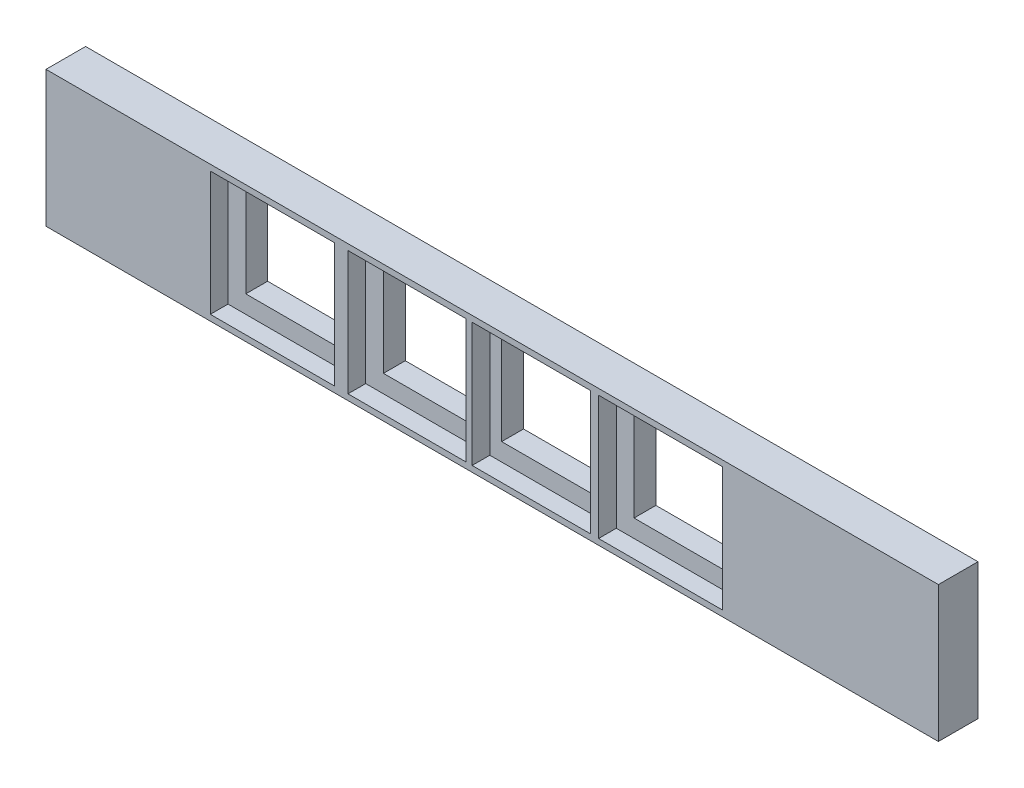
ISO-10303-21;
HEADER;
FILE_DESCRIPTION(('STEP AP214'),'2;1');
FILE_NAME('part.step','',(''),(''),'','','');
FILE_SCHEMA(('AUTOMOTIVE_DESIGN { 1 0 10303 214 1 1 1 1 }'));
ENDSEC;
DATA;
#1=APPLICATION_CONTEXT('core data for automotive mechanical design processes');
#2=APPLICATION_PROTOCOL_DEFINITION('international standard','automotive_design',2000,#1);
#3=PRODUCT_CONTEXT('',#1,'mechanical');
#4=PRODUCT('Part','Part','',(#3));
#5=PRODUCT_RELATED_PRODUCT_CATEGORY('part','',(#4));
#6=PRODUCT_DEFINITION_FORMATION('','',#4);
#7=PRODUCT_DEFINITION_CONTEXT('part definition',#1,'design');
#8=PRODUCT_DEFINITION('design','',#6,#7);
#9=PRODUCT_DEFINITION_SHAPE('','',#8);
#10=(LENGTH_UNIT() NAMED_UNIT(*) SI_UNIT(.MILLI.,.METRE.));
#11=(NAMED_UNIT(*) PLANE_ANGLE_UNIT() SI_UNIT($,.RADIAN.));
#12=(NAMED_UNIT(*) SI_UNIT($,.STERADIAN.) SOLID_ANGLE_UNIT());
#13=UNCERTAINTY_MEASURE_WITH_UNIT(LENGTH_MEASURE(1.E-05),#10,'distance_accuracy_value','');
#14=(GEOMETRIC_REPRESENTATION_CONTEXT(3) GLOBAL_UNCERTAINTY_ASSIGNED_CONTEXT((#13)) GLOBAL_UNIT_ASSIGNED_CONTEXT((#10,
#11,#12)) REPRESENTATION_CONTEXT('',''));
#15=CARTESIAN_POINT('',(0.,0.,0.));
#16=DIRECTION('',(0.,0.,1.));
#17=DIRECTION('',(1.,0.,0.));
#18=AXIS2_PLACEMENT_3D('',#15,#16,#17);
#19=CARTESIAN_POINT('',(96.5,19.,0.));
#20=DIRECTION('',(-1.,0.,0.));
#21=DIRECTION('',(0.,0.,1.));
#22=AXIS2_PLACEMENT_3D('',#19,#20,#21);
#23=PLANE('',#22);
#24=DIRECTION('',(0.,1.,0.));
#25=VECTOR('',#24,1.);
#26=CARTESIAN_POINT('',(96.5,19.,3.7));
#27=LINE('',#26,#25);
#28=CARTESIAN_POINT('',(96.5,4.,3.7));
#29=VERTEX_POINT('',#28);
#30=CARTESIAN_POINT('',(96.5,19.,3.7));
#31=VERTEX_POINT('',#30);
#32=EDGE_CURVE('E384',#29,#31,#27,.T.);
#33=ORIENTED_EDGE('',*,*,#32,.F.);
#34=DIRECTION('',(0.,0.,1.));
#35=VECTOR('',#34,1.);
#36=CARTESIAN_POINT('',(96.5,4.,0.));
#37=LINE('',#36,#35);
#38=CARTESIAN_POINT('',(96.5,4.,0.));
#39=VERTEX_POINT('',#38);
#40=EDGE_CURVE('E508',#39,#29,#37,.T.);
#41=ORIENTED_EDGE('',*,*,#40,.F.);
#42=DIRECTION('',(0.,-1.,0.));
#43=VECTOR('',#42,1.);
#44=CARTESIAN_POINT('',(96.5,19.,0.));
#45=LINE('',#44,#43);
#46=CARTESIAN_POINT('',(96.5,19.,0.));
#47=VERTEX_POINT('',#46);
#48=EDGE_CURVE('E442',#47,#39,#45,.T.);
#49=ORIENTED_EDGE('',*,*,#48,.F.);
#50=DIRECTION('',(0.,0.,1.));
#51=VECTOR('',#50,1.);
#52=CARTESIAN_POINT('',(96.5,19.,0.));
#53=LINE('',#52,#51);
#54=EDGE_CURVE('E509',#47,#31,#53,.T.);
#55=ORIENTED_EDGE('',*,*,#54,.T.);
#56=EDGE_LOOP('',(#33,#41,#49,#55));
#57=FACE_BOUND('',#56,.T.);
#58=ADVANCED_FACE('F35',(#57),#23,.F.);
#59=CARTESIAN_POINT('',(96.5,19.,0.));
#60=DIRECTION('',(0.,1.,0.));
#61=DIRECTION('',(0.,0.,1.));
#62=AXIS2_PLACEMENT_3D('',#59,#60,#61);
#63=PLANE('',#62);
#64=DIRECTION('',(1.,0.,0.));
#65=VECTOR('',#64,1.);
#66=CARTESIAN_POINT('',(96.5,19.,3.7));
#67=LINE('',#66,#65);
#68=CARTESIAN_POINT('',(111.5,19.,3.7));
#69=VERTEX_POINT('',#68);
#70=EDGE_CURVE('E382',#31,#69,#67,.T.);
#71=ORIENTED_EDGE('',*,*,#70,.F.);
#72=ORIENTED_EDGE('',*,*,#54,.F.);
#73=DIRECTION('',(-1.,0.,0.));
#74=VECTOR('',#73,1.);
#75=CARTESIAN_POINT('',(96.5,19.,0.));
#76=LINE('',#75,#74);
#77=CARTESIAN_POINT('',(111.5,19.,0.));
#78=VERTEX_POINT('',#77);
#79=EDGE_CURVE('E505',#78,#47,#76,.T.);
#80=ORIENTED_EDGE('',*,*,#79,.F.);
#81=DIRECTION('',(0.,0.,1.));
#82=VECTOR('',#81,1.);
#83=CARTESIAN_POINT('',(111.5,19.,0.));
#84=LINE('',#83,#82);
#85=EDGE_CURVE('E513',#78,#69,#84,.T.);
#86=ORIENTED_EDGE('',*,*,#85,.T.);
#87=EDGE_LOOP('',(#71,#72,#80,#86));
#88=FACE_BOUND('',#87,.T.);
#89=ADVANCED_FACE('F584',(#88),#63,.F.);
#90=CARTESIAN_POINT('',(111.5,19.,0.));
#91=DIRECTION('',(1.,0.,0.));
#92=DIRECTION('',(0.,0.,-1.));
#93=AXIS2_PLACEMENT_3D('',#90,#91,#92);
#94=PLANE('',#93);
#95=DIRECTION('',(0.,-1.,0.));
#96=VECTOR('',#95,1.);
#97=CARTESIAN_POINT('',(111.5,19.,3.7));
#98=LINE('',#97,#96);
#99=CARTESIAN_POINT('',(111.5,4.,3.7));
#100=VERTEX_POINT('',#99);
#101=EDGE_CURVE('E380',#69,#100,#98,.T.);
#102=ORIENTED_EDGE('',*,*,#101,.F.);
#103=ORIENTED_EDGE('',*,*,#85,.F.);
#104=DIRECTION('',(0.,1.,0.));
#105=VECTOR('',#104,1.);
#106=CARTESIAN_POINT('',(111.5,19.,0.));
#107=LINE('',#106,#105);
#108=CARTESIAN_POINT('',(111.5,4.,0.));
#109=VERTEX_POINT('',#108);
#110=EDGE_CURVE('E502',#109,#78,#107,.T.);
#111=ORIENTED_EDGE('',*,*,#110,.F.);
#112=DIRECTION('',(0.,0.,1.));
#113=VECTOR('',#112,1.);
#114=CARTESIAN_POINT('',(111.5,4.,0.));
#115=LINE('',#114,#113);
#116=EDGE_CURVE('E516',#109,#100,#115,.T.);
#117=ORIENTED_EDGE('',*,*,#116,.T.);
#118=EDGE_LOOP('',(#102,#103,#111,#117));
#119=FACE_BOUND('',#118,.T.);
#120=ADVANCED_FACE('F590',(#119),#94,.F.);
#121=CARTESIAN_POINT('',(96.5,4.,0.));
#122=DIRECTION('',(0.,-1.,0.));
#123=DIRECTION('',(0.,0.,-1.));
#124=AXIS2_PLACEMENT_3D('',#121,#122,#123);
#125=PLANE('',#124);
#126=DIRECTION('',(-1.,0.,0.));
#127=VECTOR('',#126,1.);
#128=CARTESIAN_POINT('',(96.5,4.,3.7));
#129=LINE('',#128,#127);
#130=EDGE_CURVE('E11',#100,#29,#129,.T.);
#131=ORIENTED_EDGE('',*,*,#130,.F.);
#132=ORIENTED_EDGE('',*,*,#116,.F.);
#133=DIRECTION('',(1.,0.,0.));
#134=VECTOR('',#133,1.);
#135=CARTESIAN_POINT('',(96.5,4.,0.));
#136=LINE('',#135,#134);
#137=EDGE_CURVE('E499',#39,#109,#136,.T.);
#138=ORIENTED_EDGE('',*,*,#137,.F.);
#139=ORIENTED_EDGE('',*,*,#40,.T.);
#140=EDGE_LOOP('',(#131,#132,#138,#139));
#141=FACE_BOUND('',#140,.T.);
#142=ADVANCED_FACE('F596',(#141),#125,.F.);
#143=CARTESIAN_POINT('',(69.1,19.,0.));
#144=DIRECTION('',(1.,0.,0.));
#145=DIRECTION('',(0.,0.,-1.));
#146=AXIS2_PLACEMENT_3D('',#143,#144,#145);
#147=PLANE('',#146);
#148=DIRECTION('',(0.,-1.,0.));
#149=VECTOR('',#148,1.);
#150=CARTESIAN_POINT('',(69.1,19.,3.7));
#151=LINE('',#150,#149);
#152=CARTESIAN_POINT('',(69.1,19.,3.7));
#153=VERTEX_POINT('',#152);
#154=CARTESIAN_POINT('',(69.1,4.,3.7));
#155=VERTEX_POINT('',#154);
#156=EDGE_CURVE('E378',#153,#155,#151,.T.);
#157=ORIENTED_EDGE('',*,*,#156,.F.);
#158=DIRECTION('',(0.,0.,1.));
#159=VECTOR('',#158,1.);
#160=CARTESIAN_POINT('',(69.1,19.,0.));
#161=LINE('',#160,#159);
#162=CARTESIAN_POINT('',(69.1,19.,0.));
#163=VERTEX_POINT('',#162);
#164=EDGE_CURVE('E464',#163,#153,#161,.T.);
#165=ORIENTED_EDGE('',*,*,#164,.F.);
#166=DIRECTION('',(0.,1.,0.));
#167=VECTOR('',#166,1.);
#168=CARTESIAN_POINT('',(69.1,19.,0.));
#169=LINE('',#168,#167);
#170=CARTESIAN_POINT('',(69.1,4.,0.));
#171=VERTEX_POINT('',#170);
#172=EDGE_CURVE('E451',#171,#163,#169,.T.);
#173=ORIENTED_EDGE('',*,*,#172,.F.);
#174=DIRECTION('',(0.,0.,1.));
#175=VECTOR('',#174,1.);
#176=CARTESIAN_POINT('',(69.1,4.,0.));
#177=LINE('',#176,#175);
#178=EDGE_CURVE('E429',#171,#155,#177,.T.);
#179=ORIENTED_EDGE('',*,*,#178,.T.);
#180=EDGE_LOOP('',(#157,#165,#173,#179));
#181=FACE_BOUND('',#180,.T.);
#182=ADVANCED_FACE('F562',(#181),#147,.F.);
#183=CARTESIAN_POINT('',(69.1,4.,0.));
#184=DIRECTION('',(0.,-1.,0.));
#185=DIRECTION('',(1.,0.,0.));
#186=AXIS2_PLACEMENT_3D('',#183,#184,#185);
#187=PLANE('',#186);
#188=DIRECTION('',(-1.,0.,0.));
#189=VECTOR('',#188,1.);
#190=CARTESIAN_POINT('',(69.1,4.,3.7));
#191=LINE('',#190,#189);
#192=CARTESIAN_POINT('',(54.1,4.,3.7));
#193=VERTEX_POINT('',#192);
#194=EDGE_CURVE('E376',#155,#193,#191,.T.);
#195=ORIENTED_EDGE('',*,*,#194,.F.);
#196=ORIENTED_EDGE('',*,*,#178,.F.);
#197=DIRECTION('',(1.,0.,0.));
#198=VECTOR('',#197,1.);
#199=CARTESIAN_POINT('',(69.1,4.,0.));
#200=LINE('',#199,#198);
#201=CARTESIAN_POINT('',(54.1,4.,0.));
#202=VERTEX_POINT('',#201);
#203=EDGE_CURVE('E461',#202,#171,#200,.T.);
#204=ORIENTED_EDGE('',*,*,#203,.F.);
#205=DIRECTION('',(0.,0.,1.));
#206=VECTOR('',#205,1.);
#207=CARTESIAN_POINT('',(54.1,4.,0.));
#208=LINE('',#207,#206);
#209=EDGE_CURVE('E467',#202,#193,#208,.T.);
#210=ORIENTED_EDGE('',*,*,#209,.T.);
#211=EDGE_LOOP('',(#195,#196,#204,#210));
#212=FACE_BOUND('',#211,.T.);
#213=ADVANCED_FACE('F571',(#212),#187,.F.);
#214=CARTESIAN_POINT('',(54.1,19.,0.));
#215=DIRECTION('',(-1.,0.,0.));
#216=DIRECTION('',(0.,0.,1.));
#217=AXIS2_PLACEMENT_3D('',#214,#215,#216);
#218=PLANE('',#217);
#219=DIRECTION('',(0.,1.,0.));
#220=VECTOR('',#219,1.);
#221=CARTESIAN_POINT('',(54.1,19.,3.7));
#222=LINE('',#221,#220);
#223=CARTESIAN_POINT('',(54.1,19.,3.7));
#224=VERTEX_POINT('',#223);
#225=EDGE_CURVE('E374',#193,#224,#222,.T.);
#226=ORIENTED_EDGE('',*,*,#225,.F.);
#227=ORIENTED_EDGE('',*,*,#209,.F.);
#228=DIRECTION('',(0.,-1.,0.));
#229=VECTOR('',#228,1.);
#230=CARTESIAN_POINT('',(54.1,19.,0.));
#231=LINE('',#230,#229);
#232=CARTESIAN_POINT('',(54.1,19.,0.));
#233=VERTEX_POINT('',#232);
#234=EDGE_CURVE('E458',#233,#202,#231,.T.);
#235=ORIENTED_EDGE('',*,*,#234,.F.);
#236=DIRECTION('',(0.,0.,1.));
#237=VECTOR('',#236,1.);
#238=CARTESIAN_POINT('',(54.1,19.,0.));
#239=LINE('',#238,#237);
#240=EDGE_CURVE('E470',#233,#224,#239,.T.);
#241=ORIENTED_EDGE('',*,*,#240,.T.);
#242=EDGE_LOOP('',(#226,#227,#235,#241));
#243=FACE_BOUND('',#242,.T.);
#244=ADVANCED_FACE('F573',(#243),#218,.F.);
#245=CARTESIAN_POINT('',(69.1,19.,0.));
#246=DIRECTION('',(0.,1.,0.));
#247=DIRECTION('',(0.,0.,1.));
#248=AXIS2_PLACEMENT_3D('',#245,#246,#247);
#249=PLANE('',#248);
#250=DIRECTION('',(1.,0.,0.));
#251=VECTOR('',#250,1.);
#252=CARTESIAN_POINT('',(69.1,19.,3.7));
#253=LINE('',#252,#251);
#254=EDGE_CURVE('E43',#224,#153,#253,.T.);
#255=ORIENTED_EDGE('',*,*,#254,.F.);
#256=ORIENTED_EDGE('',*,*,#240,.F.);
#257=DIRECTION('',(-1.,0.,0.));
#258=VECTOR('',#257,1.);
#259=CARTESIAN_POINT('',(69.1,19.,0.));
#260=LINE('',#259,#258);
#261=EDGE_CURVE('E454',#163,#233,#260,.T.);
#262=ORIENTED_EDGE('',*,*,#261,.F.);
#263=ORIENTED_EDGE('',*,*,#164,.T.);
#264=EDGE_LOOP('',(#255,#256,#262,#263));
#265=FACE_BOUND('',#264,.T.);
#266=ADVANCED_FACE('F565',(#265),#249,.F.);
#267=CARTESIAN_POINT('',(74.1,19.,0.));
#268=DIRECTION('',(-1.,0.,0.));
#269=DIRECTION('',(0.,0.,1.));
#270=AXIS2_PLACEMENT_3D('',#267,#268,#269);
#271=PLANE('',#270);
#272=DIRECTION('',(0.,1.,0.));
#273=VECTOR('',#272,1.);
#274=CARTESIAN_POINT('',(74.1,19.,3.7));
#275=LINE('',#274,#273);
#276=CARTESIAN_POINT('',(74.1,4.,3.7));
#277=VERTEX_POINT('',#276);
#278=CARTESIAN_POINT('',(74.1,19.,3.7));
#279=VERTEX_POINT('',#278);
#280=EDGE_CURVE('E372',#277,#279,#275,.T.);
#281=ORIENTED_EDGE('',*,*,#280,.F.);
#282=DIRECTION('',(0.,0.,1.));
#283=VECTOR('',#282,1.);
#284=CARTESIAN_POINT('',(74.1,4.,0.));
#285=LINE('',#284,#283);
#286=CARTESIAN_POINT('',(74.1,4.,0.));
#287=VERTEX_POINT('',#286);
#288=EDGE_CURVE('E438',#287,#277,#285,.T.);
#289=ORIENTED_EDGE('',*,*,#288,.F.);
#290=DIRECTION('',(0.,-1.,0.));
#291=VECTOR('',#290,1.);
#292=CARTESIAN_POINT('',(74.1,19.,0.));
#293=LINE('',#292,#291);
#294=CARTESIAN_POINT('',(74.1,19.,0.));
#295=VERTEX_POINT('',#294);
#296=EDGE_CURVE('E425',#295,#287,#293,.T.);
#297=ORIENTED_EDGE('',*,*,#296,.F.);
#298=DIRECTION('',(0.,0.,1.));
#299=VECTOR('',#298,1.);
#300=CARTESIAN_POINT('',(74.1,19.,0.));
#301=LINE('',#300,#299);
#302=EDGE_CURVE('E439',#295,#279,#301,.T.);
#303=ORIENTED_EDGE('',*,*,#302,.T.);
#304=EDGE_LOOP('',(#281,#289,#297,#303));
#305=FACE_BOUND('',#304,.T.);
#306=ADVANCED_FACE('F580',(#305),#271,.F.);
#307=CARTESIAN_POINT('',(74.1,19.,0.));
#308=DIRECTION('',(0.,1.,0.));
#309=DIRECTION('',(0.,0.,1.));
#310=AXIS2_PLACEMENT_3D('',#307,#308,#309);
#311=PLANE('',#310);
#312=DIRECTION('',(1.,0.,0.));
#313=VECTOR('',#312,1.);
#314=CARTESIAN_POINT('',(74.1,19.,3.7));
#315=LINE('',#314,#313);
#316=CARTESIAN_POINT('',(89.1,19.,3.7));
#317=VERTEX_POINT('',#316);
#318=EDGE_CURVE('E370',#279,#317,#315,.T.);
#319=ORIENTED_EDGE('',*,*,#318,.F.);
#320=ORIENTED_EDGE('',*,*,#302,.F.);
#321=DIRECTION('',(-1.,0.,0.));
#322=VECTOR('',#321,1.);
#323=CARTESIAN_POINT('',(74.1,19.,0.));
#324=LINE('',#323,#322);
#325=CARTESIAN_POINT('',(89.1,19.,0.));
#326=VERTEX_POINT('',#325);
#327=EDGE_CURVE('E435',#326,#295,#324,.T.);
#328=ORIENTED_EDGE('',*,*,#327,.F.);
#329=DIRECTION('',(0.,0.,1.));
#330=VECTOR('',#329,1.);
#331=CARTESIAN_POINT('',(89.1,19.,0.));
#332=LINE('',#331,#330);
#333=EDGE_CURVE('E443',#326,#317,#332,.T.);
#334=ORIENTED_EDGE('',*,*,#333,.T.);
#335=EDGE_LOOP('',(#319,#320,#328,#334));
#336=FACE_BOUND('',#335,.T.);
#337=ADVANCED_FACE('F714',(#336),#311,.F.);
#338=CARTESIAN_POINT('',(89.1,19.,0.));
#339=DIRECTION('',(1.,0.,0.));
#340=DIRECTION('',(0.,0.,-1.));
#341=AXIS2_PLACEMENT_3D('',#338,#339,#340);
#342=PLANE('',#341);
#343=DIRECTION('',(0.,-1.,0.));
#344=VECTOR('',#343,1.);
#345=CARTESIAN_POINT('',(89.1,19.,3.7));
#346=LINE('',#345,#344);
#347=CARTESIAN_POINT('',(89.1,4.,3.7));
#348=VERTEX_POINT('',#347);
#349=EDGE_CURVE('E304',#317,#348,#346,.T.);
#350=ORIENTED_EDGE('',*,*,#349,.F.);
#351=ORIENTED_EDGE('',*,*,#333,.F.);
#352=DIRECTION('',(0.,1.,0.));
#353=VECTOR('',#352,1.);
#354=CARTESIAN_POINT('',(89.1,19.,0.));
#355=LINE('',#354,#353);
#356=CARTESIAN_POINT('',(89.1,4.,0.));
#357=VERTEX_POINT('',#356);
#358=EDGE_CURVE('E432',#357,#326,#355,.T.);
#359=ORIENTED_EDGE('',*,*,#358,.F.);
#360=DIRECTION('',(0.,0.,1.));
#361=VECTOR('',#360,1.);
#362=CARTESIAN_POINT('',(89.1,4.,0.));
#363=LINE('',#362,#361);
#364=EDGE_CURVE('E446',#357,#348,#363,.T.);
#365=ORIENTED_EDGE('',*,*,#364,.T.);
#366=EDGE_LOOP('',(#350,#351,#359,#365));
#367=FACE_BOUND('',#366,.T.);
#368=ADVANCED_FACE('F717',(#367),#342,.F.);
#369=CARTESIAN_POINT('',(74.1,4.,0.));
#370=DIRECTION('',(0.,-1.,0.));
#371=DIRECTION('',(1.,0.,0.));
#372=AXIS2_PLACEMENT_3D('',#369,#370,#371);
#373=PLANE('',#372);
#374=DIRECTION('',(-1.,0.,0.));
#375=VECTOR('',#374,1.);
#376=CARTESIAN_POINT('',(74.1,4.,3.7));
#377=LINE('',#376,#375);
#378=EDGE_CURVE('E554',#348,#277,#377,.T.);
#379=ORIENTED_EDGE('',*,*,#378,.F.);
#380=ORIENTED_EDGE('',*,*,#364,.F.);
#381=DIRECTION('',(1.,0.,0.));
#382=VECTOR('',#381,1.);
#383=CARTESIAN_POINT('',(74.1,4.,0.));
#384=LINE('',#383,#382);
#385=EDGE_CURVE('E428',#287,#357,#384,.T.);
#386=ORIENTED_EDGE('',*,*,#385,.F.);
#387=ORIENTED_EDGE('',*,*,#288,.T.);
#388=EDGE_LOOP('',(#379,#380,#386,#387));
#389=FACE_BOUND('',#388,.T.);
#390=ADVANCED_FACE('F648',(#389),#373,.F.);
#391=CARTESIAN_POINT('',(45.8,19.,0.));
#392=DIRECTION('',(1.,0.,0.));
#393=DIRECTION('',(0.,0.,-1.));
#394=AXIS2_PLACEMENT_3D('',#391,#392,#393);
#395=PLANE('',#394);
#396=DIRECTION('',(0.,-1.,0.));
#397=VECTOR('',#396,1.);
#398=CARTESIAN_POINT('',(45.8,19.,3.7));
#399=LINE('',#398,#397);
#400=CARTESIAN_POINT('',(45.8,19.,3.7));
#401=VERTEX_POINT('',#400);
#402=CARTESIAN_POINT('',(45.8,4.,3.7));
#403=VERTEX_POINT('',#402);
#404=EDGE_CURVE('E422',#401,#403,#399,.T.);
#405=ORIENTED_EDGE('',*,*,#404,.F.);
#406=DIRECTION('',(0.,0.,1.));
#407=VECTOR('',#406,1.);
#408=CARTESIAN_POINT('',(45.8,19.,0.));
#409=LINE('',#408,#407);
#410=CARTESIAN_POINT('',(45.8,19.,0.));
#411=VERTEX_POINT('',#410);
#412=EDGE_CURVE('E486',#411,#401,#409,.T.);
#413=ORIENTED_EDGE('',*,*,#412,.F.);
#414=DIRECTION('',(0.,1.,0.));
#415=VECTOR('',#414,1.);
#416=CARTESIAN_POINT('',(45.8,19.,0.));
#417=LINE('',#416,#415);
#418=CARTESIAN_POINT('',(45.8,4.,0.));
#419=VERTEX_POINT('',#418);
#420=EDGE_CURVE('E424',#419,#411,#417,.T.);
#421=ORIENTED_EDGE('',*,*,#420,.F.);
#422=DIRECTION('',(0.,0.,1.));
#423=VECTOR('',#422,1.);
#424=CARTESIAN_POINT('',(45.8,4.,0.));
#425=LINE('',#424,#423);
#426=EDGE_CURVE('E455',#419,#403,#425,.T.);
#427=ORIENTED_EDGE('',*,*,#426,.T.);
#428=EDGE_LOOP('',(#405,#413,#421,#427));
#429=FACE_BOUND('',#428,.T.);
#430=ADVANCED_FACE('F646',(#429),#395,.F.);
#431=CARTESIAN_POINT('',(45.8,4.,0.));
#432=DIRECTION('',(0.,-1.,0.));
#433=DIRECTION('',(1.,0.,0.));
#434=AXIS2_PLACEMENT_3D('',#431,#432,#433);
#435=PLANE('',#434);
#436=DIRECTION('',(-1.,0.,0.));
#437=VECTOR('',#436,1.);
#438=CARTESIAN_POINT('',(45.8,4.,3.7));
#439=LINE('',#438,#437);
#440=CARTESIAN_POINT('',(30.8,4.,3.7));
#441=VERTEX_POINT('',#440);
#442=EDGE_CURVE('E420',#403,#441,#439,.T.);
#443=ORIENTED_EDGE('',*,*,#442,.F.);
#444=ORIENTED_EDGE('',*,*,#426,.F.);
#445=DIRECTION('',(1.,0.,0.));
#446=VECTOR('',#445,1.);
#447=CARTESIAN_POINT('',(45.8,4.,0.));
#448=LINE('',#447,#446);
#449=CARTESIAN_POINT('',(30.8,4.,0.));
#450=VERTEX_POINT('',#449);
#451=EDGE_CURVE('E483',#450,#419,#448,.T.);
#452=ORIENTED_EDGE('',*,*,#451,.F.);
#453=DIRECTION('',(0.,0.,1.));
#454=VECTOR('',#453,1.);
#455=CARTESIAN_POINT('',(30.8,4.,0.));
#456=LINE('',#455,#454);
#457=EDGE_CURVE('E489',#450,#441,#456,.T.);
#458=ORIENTED_EDGE('',*,*,#457,.T.);
#459=EDGE_LOOP('',(#443,#444,#452,#458));
#460=FACE_BOUND('',#459,.T.);
#461=ADVANCED_FACE('F640',(#460),#435,.F.);
#462=CARTESIAN_POINT('',(30.8,19.,0.));
#463=DIRECTION('',(-1.,0.,0.));
#464=DIRECTION('',(0.,-1.,0.));
#465=AXIS2_PLACEMENT_3D('',#462,#463,#464);
#466=PLANE('',#465);
#467=DIRECTION('',(0.,1.,0.));
#468=VECTOR('',#467,1.);
#469=CARTESIAN_POINT('',(30.8,19.,3.7));
#470=LINE('',#469,#468);
#471=CARTESIAN_POINT('',(30.8,19.,3.7));
#472=VERTEX_POINT('',#471);
#473=EDGE_CURVE('E412',#441,#472,#470,.T.);
#474=ORIENTED_EDGE('',*,*,#473,.F.);
#475=ORIENTED_EDGE('',*,*,#457,.F.);
#476=DIRECTION('',(0.,-1.,0.));
#477=VECTOR('',#476,1.);
#478=CARTESIAN_POINT('',(30.8,19.,0.));
#479=LINE('',#478,#477);
#480=CARTESIAN_POINT('',(30.8,19.,0.));
#481=VERTEX_POINT('',#480);
#482=EDGE_CURVE('E480',#481,#450,#479,.T.);
#483=ORIENTED_EDGE('',*,*,#482,.F.);
#484=DIRECTION('',(0.,0.,1.));
#485=VECTOR('',#484,1.);
#486=CARTESIAN_POINT('',(30.8,19.,0.));
#487=LINE('',#486,#485);
#488=EDGE_CURVE('E492',#481,#472,#487,.T.);
#489=ORIENTED_EDGE('',*,*,#488,.T.);
#490=EDGE_LOOP('',(#474,#475,#483,#489));
#491=FACE_BOUND('',#490,.T.);
#492=ADVANCED_FACE('F634',(#491),#466,.F.);
#493=CARTESIAN_POINT('',(45.8,19.,0.));
#494=DIRECTION('',(0.,1.,0.));
#495=DIRECTION('',(-1.,0.,0.));
#496=AXIS2_PLACEMENT_3D('',#493,#494,#495);
#497=PLANE('',#496);
#498=DIRECTION('',(1.,0.,0.));
#499=VECTOR('',#498,1.);
#500=CARTESIAN_POINT('',(45.8,19.,3.7));
#501=LINE('',#500,#499);
#502=EDGE_CURVE('E552',#472,#401,#501,.T.);
#503=ORIENTED_EDGE('',*,*,#502,.F.);
#504=ORIENTED_EDGE('',*,*,#488,.F.);
#505=DIRECTION('',(-1.,0.,0.));
#506=VECTOR('',#505,1.);
#507=CARTESIAN_POINT('',(45.8,19.,0.));
#508=LINE('',#507,#506);
#509=EDGE_CURVE('E477',#411,#481,#508,.T.);
#510=ORIENTED_EDGE('',*,*,#509,.F.);
#511=ORIENTED_EDGE('',*,*,#412,.T.);
#512=EDGE_LOOP('',(#503,#504,#510,#511));
#513=FACE_BOUND('',#512,.T.);
#514=ADVANCED_FACE('F619',(#513),#497,.F.);
#515=CARTESIAN_POINT('',(0.,0.,6.7));
#516=DIRECTION('',(0.,1.,0.));
#517=DIRECTION('',(0.,0.,1.));
#518=AXIS2_PLACEMENT_3D('',#515,#516,#517);
#519=PLANE('',#518);
#520=DIRECTION('',(1.,0.,0.));
#521=VECTOR('',#520,1.);
#522=CARTESIAN_POINT('',(0.,0.,0.));
#523=LINE('',#522,#521);
#524=CARTESIAN_POINT('',(0.,0.,0.));
#525=VERTEX_POINT('',#524);
#526=CARTESIAN_POINT('',(151.,0.,0.));
#527=VERTEX_POINT('',#526);
#528=EDGE_CURVE('E512',#525,#527,#523,.T.);
#529=ORIENTED_EDGE('',*,*,#528,.T.);
#530=DIRECTION('',(0.,0.,-1.));
#531=VECTOR('',#530,1.);
#532=CARTESIAN_POINT('',(151.,0.,6.7));
#533=LINE('',#532,#531);
#534=CARTESIAN_POINT('',(151.,0.,6.7));
#535=VERTEX_POINT('',#534);
#536=EDGE_CURVE('E549',#535,#527,#533,.T.);
#537=ORIENTED_EDGE('',*,*,#536,.F.);
#538=DIRECTION('',(1.,0.,0.));
#539=VECTOR('',#538,1.);
#540=CARTESIAN_POINT('',(0.,0.,6.7));
#541=LINE('',#540,#539);
#542=CARTESIAN_POINT('',(0.,0.,6.7));
#543=VERTEX_POINT('',#542);
#544=EDGE_CURVE('E521',#543,#535,#541,.T.);
#545=ORIENTED_EDGE('',*,*,#544,.F.);
#546=DIRECTION('',(0.,0.,-1.));
#547=VECTOR('',#546,1.);
#548=CARTESIAN_POINT('',(0.,0.,6.7));
#549=LINE('',#548,#547);
#550=EDGE_CURVE('E533',#543,#525,#549,.T.);
#551=ORIENTED_EDGE('',*,*,#550,.T.);
#552=EDGE_LOOP('',(#529,#537,#545,#551));
#553=FACE_BOUND('',#552,.T.);
#554=ADVANCED_FACE('F37',(#553),#519,.F.);
#555=CARTESIAN_POINT('',(151.,0.,6.7));
#556=DIRECTION('',(-1.,0.,0.));
#557=DIRECTION('',(0.,0.,1.));
#558=AXIS2_PLACEMENT_3D('',#555,#556,#557);
#559=PLANE('',#558);
#560=DIRECTION('',(0.,1.,0.));
#561=VECTOR('',#560,1.);
#562=CARTESIAN_POINT('',(151.,0.,0.));
#563=LINE('',#562,#561);
#564=CARTESIAN_POINT('',(151.,23.,0.));
#565=VERTEX_POINT('',#564);
#566=EDGE_CURVE('E536',#527,#565,#563,.T.);
#567=ORIENTED_EDGE('',*,*,#566,.T.);
#568=DIRECTION('',(0.,0.,-1.));
#569=VECTOR('',#568,1.);
#570=CARTESIAN_POINT('',(151.,23.,6.7));
#571=LINE('',#570,#569);
#572=CARTESIAN_POINT('',(151.,23.,6.7));
#573=VERTEX_POINT('',#572);
#574=EDGE_CURVE('E547',#573,#565,#571,.T.);
#575=ORIENTED_EDGE('',*,*,#574,.F.);
#576=DIRECTION('',(0.,1.,0.));
#577=VECTOR('',#576,1.);
#578=CARTESIAN_POINT('',(151.,0.,6.7));
#579=LINE('',#578,#577);
#580=EDGE_CURVE('E524',#535,#573,#579,.T.);
#581=ORIENTED_EDGE('',*,*,#580,.F.);
#582=ORIENTED_EDGE('',*,*,#536,.T.);
#583=EDGE_LOOP('',(#567,#575,#581,#582));
#584=FACE_BOUND('',#583,.T.);
#585=ADVANCED_FACE('F612',(#584),#559,.F.);
#586=CARTESIAN_POINT('',(0.,23.,6.7));
#587=DIRECTION('',(0.,1.,0.));
#588=DIRECTION('',(0.,0.,1.));
#589=AXIS2_PLACEMENT_3D('',#586,#587,#588);
#590=PLANE('',#589);
#591=DIRECTION('',(1.,0.,0.));
#592=VECTOR('',#591,1.);
#593=CARTESIAN_POINT('',(0.,23.,0.));
#594=LINE('',#593,#592);
#595=CARTESIAN_POINT('',(0.,23.,0.));
#596=VERTEX_POINT('',#595);
#597=EDGE_CURVE('E539',#596,#565,#594,.T.);
#598=ORIENTED_EDGE('',*,*,#597,.F.);
#599=DIRECTION('',(0.,0.,-1.));
#600=VECTOR('',#599,1.);
#601=CARTESIAN_POINT('',(0.,23.,6.7));
#602=LINE('',#601,#600);
#603=CARTESIAN_POINT('',(0.,23.,6.7));
#604=VERTEX_POINT('',#603);
#605=EDGE_CURVE('E545',#604,#596,#602,.T.);
#606=ORIENTED_EDGE('',*,*,#605,.F.);
#607=DIRECTION('',(1.,0.,0.));
#608=VECTOR('',#607,1.);
#609=CARTESIAN_POINT('',(0.,23.,6.7));
#610=LINE('',#609,#608);
#611=EDGE_CURVE('E527',#604,#573,#610,.T.);
#612=ORIENTED_EDGE('',*,*,#611,.T.);
#613=ORIENTED_EDGE('',*,*,#574,.T.);
#614=EDGE_LOOP('',(#598,#606,#612,#613));
#615=FACE_BOUND('',#614,.T.);
#616=ADVANCED_FACE('F609',(#615),#590,.T.);
#617=CARTESIAN_POINT('',(0.,0.,6.7));
#618=DIRECTION('',(-1.,0.,0.));
#619=DIRECTION('',(0.,0.,1.));
#620=AXIS2_PLACEMENT_3D('',#617,#618,#619);
#621=PLANE('',#620);
#622=DIRECTION('',(0.,1.,0.));
#623=VECTOR('',#622,1.);
#624=CARTESIAN_POINT('',(0.,0.,0.));
#625=LINE('',#624,#623);
#626=EDGE_CURVE('E525',#525,#596,#625,.T.);
#627=ORIENTED_EDGE('',*,*,#626,.F.);
#628=ORIENTED_EDGE('',*,*,#550,.F.);
#629=DIRECTION('',(0.,1.,0.));
#630=VECTOR('',#629,1.);
#631=CARTESIAN_POINT('',(0.,0.,6.7));
#632=LINE('',#631,#630);
#633=EDGE_CURVE('E530',#543,#604,#632,.T.);
#634=ORIENTED_EDGE('',*,*,#633,.T.);
#635=ORIENTED_EDGE('',*,*,#605,.T.);
#636=EDGE_LOOP('',(#627,#628,#634,#635));
#637=FACE_BOUND('',#636,.T.);
#638=ADVANCED_FACE('F601',(#637),#621,.T.);
#639=CARTESIAN_POINT('',(0.,0.,6.7));
#640=DIRECTION('',(0.,0.,1.));
#641=DIRECTION('',(1.,0.,0.));
#642=AXIS2_PLACEMENT_3D('',#639,#640,#641);
#643=PLANE('',#642);
#644=DIRECTION('',(0.,-1.,0.));
#645=VECTOR('',#644,1.);
#646=CARTESIAN_POINT('',(51.1,22.,6.7));
#647=LINE('',#646,#645);
#648=CARTESIAN_POINT('',(51.1,22.,6.7));
#649=VERTEX_POINT('',#648);
#650=CARTESIAN_POINT('',(51.1,0.999999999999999,6.7));
#651=VERTEX_POINT('',#650);
#652=EDGE_CURVE('E50',#649,#651,#647,.T.);
#653=ORIENTED_EDGE('',*,*,#652,.F.);
#654=DIRECTION('',(-1.,0.,0.));
#655=VECTOR('',#654,1.);
#656=CARTESIAN_POINT('',(51.1,22.,6.7));
#657=LINE('',#656,#655);
#658=CARTESIAN_POINT('',(71.1,22.,6.7));
#659=VERTEX_POINT('',#658);
#660=EDGE_CURVE('E288',#659,#649,#657,.T.);
#661=ORIENTED_EDGE('',*,*,#660,.F.);
#662=DIRECTION('',(0.,1.,0.));
#663=VECTOR('',#662,1.);
#664=CARTESIAN_POINT('',(71.1,22.,6.7));
#665=LINE('',#664,#663);
#666=CARTESIAN_POINT('',(71.1,0.999999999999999,6.7));
#667=VERTEX_POINT('',#666);
#668=EDGE_CURVE('E291',#667,#659,#665,.T.);
#669=ORIENTED_EDGE('',*,*,#668,.F.);
#670=DIRECTION('',(1.,0.,0.));
#671=VECTOR('',#670,1.);
#672=CARTESIAN_POINT('',(51.1,0.999999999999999,6.7));
#673=LINE('',#672,#671);
#674=EDGE_CURVE('E297',#651,#667,#673,.T.);
#675=ORIENTED_EDGE('',*,*,#674,.F.);
#676=EDGE_LOOP('',(#653,#661,#669,#675));
#677=FACE_BOUND('',#676,.T.);
#678=DIRECTION('',(0.,-1.,0.));
#679=VECTOR('',#678,1.);
#680=CARTESIAN_POINT('',(72.1,22.,6.7));
#681=LINE('',#680,#679);
#682=CARTESIAN_POINT('',(72.1,22.,6.7));
#683=VERTEX_POINT('',#682);
#684=CARTESIAN_POINT('',(72.1,1.,6.7));
#685=VERTEX_POINT('',#684);
#686=EDGE_CURVE('E58',#683,#685,#681,.T.);
#687=ORIENTED_EDGE('',*,*,#686,.F.);
#688=DIRECTION('',(-1.,0.,0.));
#689=VECTOR('',#688,1.);
#690=CARTESIAN_POINT('',(72.1,22.,6.7));
#691=LINE('',#690,#689);
#692=CARTESIAN_POINT('',(92.1,22.,6.7));
#693=VERTEX_POINT('',#692);
#694=EDGE_CURVE('E312',#693,#683,#691,.T.);
#695=ORIENTED_EDGE('',*,*,#694,.F.);
#696=DIRECTION('',(0.,1.,0.));
#697=VECTOR('',#696,1.);
#698=CARTESIAN_POINT('',(92.1,22.,6.7));
#699=LINE('',#698,#697);
#700=CARTESIAN_POINT('',(92.1,1.,6.7));
#701=VERTEX_POINT('',#700);
#702=EDGE_CURVE('E327',#701,#693,#699,.T.);
#703=ORIENTED_EDGE('',*,*,#702,.F.);
#704=DIRECTION('',(1.,0.,0.));
#705=VECTOR('',#704,1.);
#706=CARTESIAN_POINT('',(72.1,1.,6.7));
#707=LINE('',#706,#705);
#708=EDGE_CURVE('E323',#685,#701,#707,.T.);
#709=ORIENTED_EDGE('',*,*,#708,.F.);
#710=EDGE_LOOP('',(#687,#695,#703,#709));
#711=FACE_BOUND('',#710,.T.);
#712=DIRECTION('',(0.,-1.,0.));
#713=VECTOR('',#712,1.);
#714=CARTESIAN_POINT('',(93.5,22.,6.7));
#715=LINE('',#714,#713);
#716=CARTESIAN_POINT('',(93.5,22.,6.7));
#717=VERTEX_POINT('',#716);
#718=CARTESIAN_POINT('',(93.5,1.,6.7));
#719=VERTEX_POINT('',#718);
#720=EDGE_CURVE('E352',#717,#719,#715,.T.);
#721=ORIENTED_EDGE('',*,*,#720,.F.);
#722=DIRECTION('',(-1.,0.,0.));
#723=VECTOR('',#722,1.);
#724=CARTESIAN_POINT('',(93.5,22.,6.7));
#725=LINE('',#724,#723);
#726=CARTESIAN_POINT('',(114.5,22.,6.7));
#727=VERTEX_POINT('',#726);
#728=EDGE_CURVE('E342',#727,#717,#725,.T.);
#729=ORIENTED_EDGE('',*,*,#728,.F.);
#730=DIRECTION('',(0.,1.,0.));
#731=VECTOR('',#730,1.);
#732=CARTESIAN_POINT('',(114.5,22.,6.7));
#733=LINE('',#732,#731);
#734=CARTESIAN_POINT('',(114.5,1.,6.7));
#735=VERTEX_POINT('',#734);
#736=EDGE_CURVE('E357',#735,#727,#733,.T.);
#737=ORIENTED_EDGE('',*,*,#736,.F.);
#738=DIRECTION('',(1.,0.,0.));
#739=VECTOR('',#738,1.);
#740=CARTESIAN_POINT('',(93.5,1.,6.7));
#741=LINE('',#740,#739);
#742=EDGE_CURVE('E354',#719,#735,#741,.T.);
#743=ORIENTED_EDGE('',*,*,#742,.F.);
#744=EDGE_LOOP('',(#721,#729,#737,#743));
#745=FACE_BOUND('',#744,.T.);
#746=DIRECTION('',(0.,-1.,0.));
#747=VECTOR('',#746,1.);
#748=CARTESIAN_POINT('',(27.8,22.,6.7));
#749=LINE('',#748,#747);
#750=CARTESIAN_POINT('',(27.8,22.,6.7));
#751=VERTEX_POINT('',#750);
#752=CARTESIAN_POINT('',(27.8,0.999999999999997,6.7));
#753=VERTEX_POINT('',#752);
#754=EDGE_CURVE('E386',#751,#753,#749,.T.);
#755=ORIENTED_EDGE('',*,*,#754,.F.);
#756=DIRECTION('',(-1.,0.,0.));
#757=VECTOR('',#756,1.);
#758=CARTESIAN_POINT('',(27.8,22.,6.7));
#759=LINE('',#758,#757);
#760=CARTESIAN_POINT('',(48.8,22.,6.7));
#761=VERTEX_POINT('',#760);
#762=EDGE_CURVE('E391',#761,#751,#759,.T.);
#763=ORIENTED_EDGE('',*,*,#762,.F.);
#764=DIRECTION('',(0.,1.,0.));
#765=VECTOR('',#764,1.);
#766=CARTESIAN_POINT('',(48.8,22.,6.7));
#767=LINE('',#766,#765);
#768=CARTESIAN_POINT('',(48.8,0.999999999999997,6.7));
#769=VERTEX_POINT('',#768);
#770=EDGE_CURVE('E405',#769,#761,#767,.T.);
#771=ORIENTED_EDGE('',*,*,#770,.F.);
#772=DIRECTION('',(1.,0.,0.));
#773=VECTOR('',#772,1.);
#774=CARTESIAN_POINT('',(27.8,0.999999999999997,6.7));
#775=LINE('',#774,#773);
#776=EDGE_CURVE('E402',#753,#769,#775,.T.);
#777=ORIENTED_EDGE('',*,*,#776,.F.);
#778=EDGE_LOOP('',(#755,#763,#771,#777));
#779=FACE_BOUND('',#778,.T.);
#780=ORIENTED_EDGE('',*,*,#544,.T.);
#781=ORIENTED_EDGE('',*,*,#580,.T.);
#782=ORIENTED_EDGE('',*,*,#611,.F.);
#783=ORIENTED_EDGE('',*,*,#633,.F.);
#784=EDGE_LOOP('',(#780,#781,#782,#783));
#785=FACE_BOUND('',#784,.T.);
#786=ADVANCED_FACE('F598',(#677,#711,#745,#779,#785),#643,.T.);
#787=CARTESIAN_POINT('',(0.,0.,0.));
#788=DIRECTION('',(0.,0.,1.));
#789=DIRECTION('',(1.,0.,0.));
#790=AXIS2_PLACEMENT_3D('',#787,#788,#789);
#791=PLANE('',#790);
#792=ORIENTED_EDGE('',*,*,#327,.T.);
#793=ORIENTED_EDGE('',*,*,#296,.T.);
#794=ORIENTED_EDGE('',*,*,#385,.T.);
#795=ORIENTED_EDGE('',*,*,#358,.T.);
#796=EDGE_LOOP('',(#792,#793,#794,#795));
#797=FACE_BOUND('',#796,.T.);
#798=ORIENTED_EDGE('',*,*,#203,.T.);
#799=ORIENTED_EDGE('',*,*,#172,.T.);
#800=ORIENTED_EDGE('',*,*,#261,.T.);
#801=ORIENTED_EDGE('',*,*,#234,.T.);
#802=EDGE_LOOP('',(#798,#799,#800,#801));
#803=FACE_BOUND('',#802,.T.);
#804=ORIENTED_EDGE('',*,*,#451,.T.);
#805=ORIENTED_EDGE('',*,*,#420,.T.);
#806=ORIENTED_EDGE('',*,*,#509,.T.);
#807=ORIENTED_EDGE('',*,*,#482,.T.);
#808=EDGE_LOOP('',(#804,#805,#806,#807));
#809=FACE_BOUND('',#808,.T.);
#810=ORIENTED_EDGE('',*,*,#79,.T.);
#811=ORIENTED_EDGE('',*,*,#48,.T.);
#812=ORIENTED_EDGE('',*,*,#137,.T.);
#813=ORIENTED_EDGE('',*,*,#110,.T.);
#814=EDGE_LOOP('',(#810,#811,#812,#813));
#815=FACE_BOUND('',#814,.T.);
#816=ORIENTED_EDGE('',*,*,#528,.F.);
#817=ORIENTED_EDGE('',*,*,#626,.T.);
#818=ORIENTED_EDGE('',*,*,#597,.T.);
#819=ORIENTED_EDGE('',*,*,#566,.F.);
#820=EDGE_LOOP('',(#816,#817,#818,#819));
#821=FACE_BOUND('',#820,.T.);
#822=ADVANCED_FACE('F567',(#797,#803,#809,#815,#821),#791,.F.);
#823=CARTESIAN_POINT('',(0.,0.,3.7));
#824=DIRECTION('',(0.,0.,1.));
#825=DIRECTION('',(1.,0.,0.));
#826=AXIS2_PLACEMENT_3D('',#823,#824,#825);
#827=PLANE('',#826);
#828=DIRECTION('',(0.,-1.,0.));
#829=VECTOR('',#828,1.);
#830=CARTESIAN_POINT('',(27.8,22.,3.7));
#831=LINE('',#830,#829);
#832=CARTESIAN_POINT('',(27.8,22.,3.7));
#833=VERTEX_POINT('',#832);
#834=CARTESIAN_POINT('',(27.8,0.999999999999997,3.7));
#835=VERTEX_POINT('',#834);
#836=EDGE_CURVE('E387',#833,#835,#831,.T.);
#837=ORIENTED_EDGE('',*,*,#836,.T.);
#838=DIRECTION('',(1.,0.,0.));
#839=VECTOR('',#838,1.);
#840=CARTESIAN_POINT('',(27.8,0.999999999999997,3.7));
#841=LINE('',#840,#839);
#842=CARTESIAN_POINT('',(48.8,0.999999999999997,3.7));
#843=VERTEX_POINT('',#842);
#844=EDGE_CURVE('E390',#835,#843,#841,.T.);
#845=ORIENTED_EDGE('',*,*,#844,.T.);
#846=DIRECTION('',(0.,1.,0.));
#847=VECTOR('',#846,1.);
#848=CARTESIAN_POINT('',(48.8,22.,3.7));
#849=LINE('',#848,#847);
#850=CARTESIAN_POINT('',(48.8,22.,3.7));
#851=VERTEX_POINT('',#850);
#852=EDGE_CURVE('E394',#843,#851,#849,.T.);
#853=ORIENTED_EDGE('',*,*,#852,.T.);
#854=DIRECTION('',(-1.,0.,0.));
#855=VECTOR('',#854,1.);
#856=CARTESIAN_POINT('',(27.8,22.,3.7));
#857=LINE('',#856,#855);
#858=EDGE_CURVE('E397',#851,#833,#857,.T.);
#859=ORIENTED_EDGE('',*,*,#858,.T.);
#860=EDGE_LOOP('',(#837,#845,#853,#859));
#861=FACE_BOUND('',#860,.T.);
#862=ORIENTED_EDGE('',*,*,#404,.T.);
#863=ORIENTED_EDGE('',*,*,#442,.T.);
#864=ORIENTED_EDGE('',*,*,#473,.T.);
#865=ORIENTED_EDGE('',*,*,#502,.T.);
#866=EDGE_LOOP('',(#862,#863,#864,#865));
#867=FACE_BOUND('',#866,.T.);
#868=ADVANCED_FACE('F605',(#861,#867),#827,.T.);
#869=CARTESIAN_POINT('',(27.8,22.,3.7));
#870=DIRECTION('',(-1.,0.,0.));
#871=DIRECTION('',(0.,0.,1.));
#872=AXIS2_PLACEMENT_3D('',#869,#870,#871);
#873=PLANE('',#872);
#874=ORIENTED_EDGE('',*,*,#754,.T.);
#875=DIRECTION('',(0.,0.,1.));
#876=VECTOR('',#875,1.);
#877=CARTESIAN_POINT('',(27.8,0.999999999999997,3.7));
#878=LINE('',#877,#876);
#879=EDGE_CURVE('E400',#835,#753,#878,.T.);
#880=ORIENTED_EDGE('',*,*,#879,.F.);
#881=ORIENTED_EDGE('',*,*,#836,.F.);
#882=DIRECTION('',(0.,0.,1.));
#883=VECTOR('',#882,1.);
#884=CARTESIAN_POINT('',(27.8,22.,3.7));
#885=LINE('',#884,#883);
#886=EDGE_CURVE('E410',#833,#751,#885,.T.);
#887=ORIENTED_EDGE('',*,*,#886,.T.);
#888=EDGE_LOOP('',(#874,#880,#881,#887));
#889=FACE_BOUND('',#888,.T.);
#890=ADVANCED_FACE('F696',(#889),#873,.F.);
#891=CARTESIAN_POINT('',(27.8,22.,3.7));
#892=DIRECTION('',(0.,1.,0.));
#893=DIRECTION('',(0.,0.,1.));
#894=AXIS2_PLACEMENT_3D('',#891,#892,#893);
#895=PLANE('',#894);
#896=ORIENTED_EDGE('',*,*,#762,.T.);
#897=ORIENTED_EDGE('',*,*,#886,.F.);
#898=ORIENTED_EDGE('',*,*,#858,.F.);
#899=DIRECTION('',(0.,0.,1.));
#900=VECTOR('',#899,1.);
#901=CARTESIAN_POINT('',(48.8,22.,3.7));
#902=LINE('',#901,#900);
#903=EDGE_CURVE('E413',#851,#761,#902,.T.);
#904=ORIENTED_EDGE('',*,*,#903,.T.);
#905=EDGE_LOOP('',(#896,#897,#898,#904));
#906=FACE_BOUND('',#905,.T.);
#907=ADVANCED_FACE('F698',(#906),#895,.F.);
#908=CARTESIAN_POINT('',(48.8,22.,3.7));
#909=DIRECTION('',(1.,0.,0.));
#910=DIRECTION('',(0.,0.,-1.));
#911=AXIS2_PLACEMENT_3D('',#908,#909,#910);
#912=PLANE('',#911);
#913=ORIENTED_EDGE('',*,*,#770,.T.);
#914=ORIENTED_EDGE('',*,*,#903,.F.);
#915=ORIENTED_EDGE('',*,*,#852,.F.);
#916=DIRECTION('',(0.,0.,1.));
#917=VECTOR('',#916,1.);
#918=CARTESIAN_POINT('',(48.8,0.999999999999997,3.7));
#919=LINE('',#918,#917);
#920=EDGE_CURVE('E415',#843,#769,#919,.T.);
#921=ORIENTED_EDGE('',*,*,#920,.T.);
#922=EDGE_LOOP('',(#913,#914,#915,#921));
#923=FACE_BOUND('',#922,.T.);
#924=ADVANCED_FACE('F701',(#923),#912,.F.);
#925=CARTESIAN_POINT('',(27.8,0.999999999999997,3.7));
#926=DIRECTION('',(0.,-1.,0.));
#927=DIRECTION('',(0.,0.,-1.));
#928=AXIS2_PLACEMENT_3D('',#925,#926,#927);
#929=PLANE('',#928);
#930=ORIENTED_EDGE('',*,*,#776,.T.);
#931=ORIENTED_EDGE('',*,*,#920,.F.);
#932=ORIENTED_EDGE('',*,*,#844,.F.);
#933=ORIENTED_EDGE('',*,*,#879,.T.);
#934=EDGE_LOOP('',(#930,#931,#932,#933));
#935=FACE_BOUND('',#934,.T.);
#936=ADVANCED_FACE('F705',(#935),#929,.F.);
#937=CARTESIAN_POINT('',(0.,0.,3.7));
#938=DIRECTION('',(0.,0.,1.));
#939=DIRECTION('',(1.,0.,0.));
#940=AXIS2_PLACEMENT_3D('',#937,#938,#939);
#941=PLANE('',#940);
#942=DIRECTION('',(0.,-1.,0.));
#943=VECTOR('',#942,1.);
#944=CARTESIAN_POINT('',(72.1,22.,3.7));
#945=LINE('',#944,#943);
#946=CARTESIAN_POINT('',(72.1,22.,3.7));
#947=VERTEX_POINT('',#946);
#948=CARTESIAN_POINT('',(72.1,1.,3.7));
#949=VERTEX_POINT('',#948);
#950=EDGE_CURVE('E308',#947,#949,#945,.T.);
#951=ORIENTED_EDGE('',*,*,#950,.T.);
#952=DIRECTION('',(1.,0.,0.));
#953=VECTOR('',#952,1.);
#954=CARTESIAN_POINT('',(72.1,1.,3.7));
#955=LINE('',#954,#953);
#956=CARTESIAN_POINT('',(92.1,1.,3.7));
#957=VERTEX_POINT('',#956);
#958=EDGE_CURVE('E311',#949,#957,#955,.T.);
#959=ORIENTED_EDGE('',*,*,#958,.T.);
#960=DIRECTION('',(0.,1.,0.));
#961=VECTOR('',#960,1.);
#962=CARTESIAN_POINT('',(92.1,22.,3.7));
#963=LINE('',#962,#961);
#964=CARTESIAN_POINT('',(92.1,22.,3.7));
#965=VERTEX_POINT('',#964);
#966=EDGE_CURVE('E315',#957,#965,#963,.T.);
#967=ORIENTED_EDGE('',*,*,#966,.T.);
#968=DIRECTION('',(-1.,0.,0.));
#969=VECTOR('',#968,1.);
#970=CARTESIAN_POINT('',(72.1,22.,3.7));
#971=LINE('',#970,#969);
#972=EDGE_CURVE('E318',#965,#947,#971,.T.);
#973=ORIENTED_EDGE('',*,*,#972,.T.);
#974=EDGE_LOOP('',(#951,#959,#967,#973));
#975=FACE_BOUND('',#974,.T.);
#976=ORIENTED_EDGE('',*,*,#280,.T.);
#977=ORIENTED_EDGE('',*,*,#318,.T.);
#978=ORIENTED_EDGE('',*,*,#349,.T.);
#979=ORIENTED_EDGE('',*,*,#378,.T.);
#980=EDGE_LOOP('',(#976,#977,#978,#979));
#981=FACE_BOUND('',#980,.T.);
#982=ADVANCED_FACE('F709',(#975,#981),#941,.T.);
#983=CARTESIAN_POINT('',(72.1,22.,3.7));
#984=DIRECTION('',(-1.,0.,0.));
#985=DIRECTION('',(0.,0.,1.));
#986=AXIS2_PLACEMENT_3D('',#983,#984,#985);
#987=PLANE('',#986);
#988=ORIENTED_EDGE('',*,*,#686,.T.);
#989=DIRECTION('',(0.,0.,1.));
#990=VECTOR('',#989,1.);
#991=CARTESIAN_POINT('',(72.1,1.,3.7));
#992=LINE('',#991,#990);
#993=EDGE_CURVE('E321',#949,#685,#992,.T.);
#994=ORIENTED_EDGE('',*,*,#993,.F.);
#995=ORIENTED_EDGE('',*,*,#950,.F.);
#996=DIRECTION('',(0.,0.,1.));
#997=VECTOR('',#996,1.);
#998=CARTESIAN_POINT('',(72.1,22.,3.7));
#999=LINE('',#998,#997);
#1000=EDGE_CURVE('E298',#947,#683,#999,.T.);
#1001=ORIENTED_EDGE('',*,*,#1000,.T.);
#1002=EDGE_LOOP('',(#988,#994,#995,#1001));
#1003=FACE_BOUND('',#1002,.T.);
#1004=ADVANCED_FACE('F681',(#1003),#987,.F.);
#1005=CARTESIAN_POINT('',(72.1,22.,3.7));
#1006=DIRECTION('',(0.,1.,0.));
#1007=DIRECTION('',(0.,0.,1.));
#1008=AXIS2_PLACEMENT_3D('',#1005,#1006,#1007);
#1009=PLANE('',#1008);
#1010=ORIENTED_EDGE('',*,*,#694,.T.);
#1011=ORIENTED_EDGE('',*,*,#1000,.F.);
#1012=ORIENTED_EDGE('',*,*,#972,.F.);
#1013=DIRECTION('',(0.,0.,1.));
#1014=VECTOR('',#1013,1.);
#1015=CARTESIAN_POINT('',(92.1,22.,3.7));
#1016=LINE('',#1015,#1014);
#1017=EDGE_CURVE('E333',#965,#693,#1016,.T.);
#1018=ORIENTED_EDGE('',*,*,#1017,.T.);
#1019=EDGE_LOOP('',(#1010,#1011,#1012,#1018));
#1020=FACE_BOUND('',#1019,.T.);
#1021=ADVANCED_FACE('F744',(#1020),#1009,.F.);
#1022=CARTESIAN_POINT('',(92.1,22.,3.7));
#1023=DIRECTION('',(1.,0.,0.));
#1024=DIRECTION('',(0.,0.,-1.));
#1025=AXIS2_PLACEMENT_3D('',#1022,#1023,#1024);
#1026=PLANE('',#1025);
#1027=ORIENTED_EDGE('',*,*,#702,.T.);
#1028=ORIENTED_EDGE('',*,*,#1017,.F.);
#1029=ORIENTED_EDGE('',*,*,#966,.F.);
#1030=DIRECTION('',(0.,0.,1.));
#1031=VECTOR('',#1030,1.);
#1032=CARTESIAN_POINT('',(92.1,1.,3.7));
#1033=LINE('',#1032,#1031);
#1034=EDGE_CURVE('E335',#957,#701,#1033,.T.);
#1035=ORIENTED_EDGE('',*,*,#1034,.T.);
#1036=EDGE_LOOP('',(#1027,#1028,#1029,#1035));
#1037=FACE_BOUND('',#1036,.T.);
#1038=ADVANCED_FACE('F749',(#1037),#1026,.F.);
#1039=CARTESIAN_POINT('',(72.1,1.,3.7));
#1040=DIRECTION('',(0.,-1.,0.));
#1041=DIRECTION('',(0.,0.,-1.));
#1042=AXIS2_PLACEMENT_3D('',#1039,#1040,#1041);
#1043=PLANE('',#1042);
#1044=ORIENTED_EDGE('',*,*,#708,.T.);
#1045=ORIENTED_EDGE('',*,*,#1034,.F.);
#1046=ORIENTED_EDGE('',*,*,#958,.F.);
#1047=ORIENTED_EDGE('',*,*,#993,.T.);
#1048=EDGE_LOOP('',(#1044,#1045,#1046,#1047));
#1049=FACE_BOUND('',#1048,.T.);
#1050=ADVANCED_FACE('F752',(#1049),#1043,.F.);
#1051=CARTESIAN_POINT('',(0.,0.,3.7));
#1052=DIRECTION('',(0.,0.,1.));
#1053=DIRECTION('',(1.,0.,0.));
#1054=AXIS2_PLACEMENT_3D('',#1051,#1052,#1053);
#1055=PLANE('',#1054);
#1056=DIRECTION('',(0.,-1.,0.));
#1057=VECTOR('',#1056,1.);
#1058=CARTESIAN_POINT('',(51.1,22.,3.7));
#1059=LINE('',#1058,#1057);
#1060=CARTESIAN_POINT('',(51.1,22.,3.7));
#1061=VERTEX_POINT('',#1060);
#1062=CARTESIAN_POINT('',(51.1,0.999999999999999,3.7));
#1063=VERTEX_POINT('',#1062);
#1064=EDGE_CURVE('E269',#1061,#1063,#1059,.T.);
#1065=ORIENTED_EDGE('',*,*,#1064,.T.);
#1066=DIRECTION('',(1.,0.,0.));
#1067=VECTOR('',#1066,1.);
#1068=CARTESIAN_POINT('',(51.1,0.999999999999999,3.7));
#1069=LINE('',#1068,#1067);
#1070=CARTESIAN_POINT('',(71.1,0.999999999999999,3.7));
#1071=VERTEX_POINT('',#1070);
#1072=EDGE_CURVE('E278',#1063,#1071,#1069,.T.);
#1073=ORIENTED_EDGE('',*,*,#1072,.T.);
#1074=DIRECTION('',(0.,1.,0.));
#1075=VECTOR('',#1074,1.);
#1076=CARTESIAN_POINT('',(71.1,22.,3.7));
#1077=LINE('',#1076,#1075);
#1078=CARTESIAN_POINT('',(71.1,22.,3.7));
#1079=VERTEX_POINT('',#1078);
#1080=EDGE_CURVE('E283',#1071,#1079,#1077,.T.);
#1081=ORIENTED_EDGE('',*,*,#1080,.T.);
#1082=DIRECTION('',(-1.,0.,0.));
#1083=VECTOR('',#1082,1.);
#1084=CARTESIAN_POINT('',(51.1,22.,3.7));
#1085=LINE('',#1084,#1083);
#1086=EDGE_CURVE('E275',#1079,#1061,#1085,.T.);
#1087=ORIENTED_EDGE('',*,*,#1086,.T.);
#1088=EDGE_LOOP('',(#1065,#1073,#1081,#1087));
#1089=FACE_BOUND('',#1088,.T.);
#1090=ORIENTED_EDGE('',*,*,#156,.T.);
#1091=ORIENTED_EDGE('',*,*,#194,.T.);
#1092=ORIENTED_EDGE('',*,*,#225,.T.);
#1093=ORIENTED_EDGE('',*,*,#254,.T.);
#1094=EDGE_LOOP('',(#1090,#1091,#1092,#1093));
#1095=FACE_BOUND('',#1094,.T.);
#1096=ADVANCED_FACE('F285',(#1089,#1095),#1055,.T.);
#1097=CARTESIAN_POINT('',(51.1,22.,3.7));
#1098=DIRECTION('',(-1.,0.,0.));
#1099=DIRECTION('',(0.,0.,1.));
#1100=AXIS2_PLACEMENT_3D('',#1097,#1098,#1099);
#1101=PLANE('',#1100);
#1102=ORIENTED_EDGE('',*,*,#652,.T.);
#1103=DIRECTION('',(0.,0.,1.));
#1104=VECTOR('',#1103,1.);
#1105=CARTESIAN_POINT('',(51.1,0.999999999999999,3.7));
#1106=LINE('',#1105,#1104);
#1107=EDGE_CURVE('E265',#1063,#651,#1106,.T.);
#1108=ORIENTED_EDGE('',*,*,#1107,.F.);
#1109=ORIENTED_EDGE('',*,*,#1064,.F.);
#1110=DIRECTION('',(0.,0.,1.));
#1111=VECTOR('',#1110,1.);
#1112=CARTESIAN_POINT('',(51.1,22.,3.7));
#1113=LINE('',#1112,#1111);
#1114=EDGE_CURVE('E302',#1061,#649,#1113,.T.);
#1115=ORIENTED_EDGE('',*,*,#1114,.T.);
#1116=EDGE_LOOP('',(#1102,#1108,#1109,#1115));
#1117=FACE_BOUND('',#1116,.T.);
#1118=ADVANCED_FACE('F267',(#1117),#1101,.F.);
#1119=CARTESIAN_POINT('',(51.1,22.,3.7));
#1120=DIRECTION('',(0.,1.,0.));
#1121=DIRECTION('',(0.,0.,1.));
#1122=AXIS2_PLACEMENT_3D('',#1119,#1120,#1121);
#1123=PLANE('',#1122);
#1124=ORIENTED_EDGE('',*,*,#660,.T.);
#1125=ORIENTED_EDGE('',*,*,#1114,.F.);
#1126=ORIENTED_EDGE('',*,*,#1086,.F.);
#1127=DIRECTION('',(0.,0.,1.));
#1128=VECTOR('',#1127,1.);
#1129=CARTESIAN_POINT('',(71.1,22.,3.7));
#1130=LINE('',#1129,#1128);
#1131=EDGE_CURVE('E305',#1079,#659,#1130,.T.);
#1132=ORIENTED_EDGE('',*,*,#1131,.T.);
#1133=EDGE_LOOP('',(#1124,#1125,#1126,#1132));
#1134=FACE_BOUND('',#1133,.T.);
#1135=ADVANCED_FACE('F935',(#1134),#1123,.F.);
#1136=CARTESIAN_POINT('',(71.1,22.,3.7));
#1137=DIRECTION('',(1.,0.,0.));
#1138=DIRECTION('',(0.,0.,-1.));
#1139=AXIS2_PLACEMENT_3D('',#1136,#1137,#1138);
#1140=PLANE('',#1139);
#1141=ORIENTED_EDGE('',*,*,#668,.T.);
#1142=ORIENTED_EDGE('',*,*,#1131,.F.);
#1143=ORIENTED_EDGE('',*,*,#1080,.F.);
#1144=DIRECTION('',(0.,0.,1.));
#1145=VECTOR('',#1144,1.);
#1146=CARTESIAN_POINT('',(71.1,0.999999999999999,3.7));
#1147=LINE('',#1146,#1145);
#1148=EDGE_CURVE('E274',#1071,#667,#1147,.T.);
#1149=ORIENTED_EDGE('',*,*,#1148,.T.);
#1150=EDGE_LOOP('',(#1141,#1142,#1143,#1149));
#1151=FACE_BOUND('',#1150,.T.);
#1152=ADVANCED_FACE('F677',(#1151),#1140,.F.);
#1153=CARTESIAN_POINT('',(51.1,0.999999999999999,3.7));
#1154=DIRECTION('',(0.,-1.,0.));
#1155=DIRECTION('',(0.,0.,-1.));
#1156=AXIS2_PLACEMENT_3D('',#1153,#1154,#1155);
#1157=PLANE('',#1156);
#1158=ORIENTED_EDGE('',*,*,#674,.T.);
#1159=ORIENTED_EDGE('',*,*,#1148,.F.);
#1160=ORIENTED_EDGE('',*,*,#1072,.F.);
#1161=ORIENTED_EDGE('',*,*,#1107,.T.);
#1162=EDGE_LOOP('',(#1158,#1159,#1160,#1161));
#1163=FACE_BOUND('',#1162,.T.);
#1164=ADVANCED_FACE('F279',(#1163),#1157,.F.);
#1165=CARTESIAN_POINT('',(0.,0.,3.7));
#1166=DIRECTION('',(0.,0.,1.));
#1167=DIRECTION('',(1.,0.,0.));
#1168=AXIS2_PLACEMENT_3D('',#1165,#1166,#1167);
#1169=PLANE('',#1168);
#1170=DIRECTION('',(0.,-1.,0.));
#1171=VECTOR('',#1170,1.);
#1172=CARTESIAN_POINT('',(93.5,22.,3.7));
#1173=LINE('',#1172,#1171);
#1174=CARTESIAN_POINT('',(93.5,22.,3.7));
#1175=VERTEX_POINT('',#1174);
#1176=CARTESIAN_POINT('',(93.5,1.,3.7));
#1177=VERTEX_POINT('',#1176);
#1178=EDGE_CURVE('E338',#1175,#1177,#1173,.T.);
#1179=ORIENTED_EDGE('',*,*,#1178,.T.);
#1180=DIRECTION('',(1.,0.,0.));
#1181=VECTOR('',#1180,1.);
#1182=CARTESIAN_POINT('',(93.5,1.,3.7));
#1183=LINE('',#1182,#1181);
#1184=CARTESIAN_POINT('',(114.5,1.,3.7));
#1185=VERTEX_POINT('',#1184);
#1186=EDGE_CURVE('E341',#1177,#1185,#1183,.T.);
#1187=ORIENTED_EDGE('',*,*,#1186,.T.);
#1188=DIRECTION('',(0.,1.,0.));
#1189=VECTOR('',#1188,1.);
#1190=CARTESIAN_POINT('',(114.5,22.,3.7));
#1191=LINE('',#1190,#1189);
#1192=CARTESIAN_POINT('',(114.5,22.,3.7));
#1193=VERTEX_POINT('',#1192);
#1194=EDGE_CURVE('E345',#1185,#1193,#1191,.T.);
#1195=ORIENTED_EDGE('',*,*,#1194,.T.);
#1196=DIRECTION('',(-1.,0.,0.));
#1197=VECTOR('',#1196,1.);
#1198=CARTESIAN_POINT('',(93.5,22.,3.7));
#1199=LINE('',#1198,#1197);
#1200=EDGE_CURVE('E348',#1193,#1175,#1199,.T.);
#1201=ORIENTED_EDGE('',*,*,#1200,.T.);
#1202=EDGE_LOOP('',(#1179,#1187,#1195,#1201));
#1203=FACE_BOUND('',#1202,.T.);
#1204=ORIENTED_EDGE('',*,*,#32,.T.);
#1205=ORIENTED_EDGE('',*,*,#70,.T.);
#1206=ORIENTED_EDGE('',*,*,#101,.T.);
#1207=ORIENTED_EDGE('',*,*,#130,.T.);
#1208=EDGE_LOOP('',(#1204,#1205,#1206,#1207));
#1209=FACE_BOUND('',#1208,.T.);
#1210=ADVANCED_FACE('F665',(#1203,#1209),#1169,.T.);
#1211=CARTESIAN_POINT('',(93.5,22.,3.7));
#1212=DIRECTION('',(-1.,0.,0.));
#1213=DIRECTION('',(0.,0.,1.));
#1214=AXIS2_PLACEMENT_3D('',#1211,#1212,#1213);
#1215=PLANE('',#1214);
#1216=ORIENTED_EDGE('',*,*,#720,.T.);
#1217=DIRECTION('',(0.,0.,1.));
#1218=VECTOR('',#1217,1.);
#1219=CARTESIAN_POINT('',(93.5,1.,3.7));
#1220=LINE('',#1219,#1218);
#1221=EDGE_CURVE('E351',#1177,#719,#1220,.T.);
#1222=ORIENTED_EDGE('',*,*,#1221,.F.);
#1223=ORIENTED_EDGE('',*,*,#1178,.F.);
#1224=DIRECTION('',(0.,0.,1.));
#1225=VECTOR('',#1224,1.);
#1226=CARTESIAN_POINT('',(93.5,22.,3.7));
#1227=LINE('',#1226,#1225);
#1228=EDGE_CURVE('E324',#1175,#717,#1227,.T.);
#1229=ORIENTED_EDGE('',*,*,#1228,.T.);
#1230=EDGE_LOOP('',(#1216,#1222,#1223,#1229));
#1231=FACE_BOUND('',#1230,.T.);
#1232=ADVANCED_FACE('F667',(#1231),#1215,.F.);
#1233=CARTESIAN_POINT('',(93.5,22.,3.7));
#1234=DIRECTION('',(0.,1.,0.));
#1235=DIRECTION('',(0.,0.,1.));
#1236=AXIS2_PLACEMENT_3D('',#1233,#1234,#1235);
#1237=PLANE('',#1236);
#1238=ORIENTED_EDGE('',*,*,#728,.T.);
#1239=ORIENTED_EDGE('',*,*,#1228,.F.);
#1240=ORIENTED_EDGE('',*,*,#1200,.F.);
#1241=DIRECTION('',(0.,0.,1.));
#1242=VECTOR('',#1241,1.);
#1243=CARTESIAN_POINT('',(114.5,22.,3.7));
#1244=LINE('',#1243,#1242);
#1245=EDGE_CURVE('E363',#1193,#727,#1244,.T.);
#1246=ORIENTED_EDGE('',*,*,#1245,.T.);
#1247=EDGE_LOOP('',(#1238,#1239,#1240,#1246));
#1248=FACE_BOUND('',#1247,.T.);
#1249=ADVANCED_FACE('F674',(#1248),#1237,.F.);
#1250=CARTESIAN_POINT('',(114.5,22.,3.7));
#1251=DIRECTION('',(1.,0.,0.));
#1252=DIRECTION('',(0.,0.,-1.));
#1253=AXIS2_PLACEMENT_3D('',#1250,#1251,#1252);
#1254=PLANE('',#1253);
#1255=ORIENTED_EDGE('',*,*,#736,.T.);
#1256=ORIENTED_EDGE('',*,*,#1245,.F.);
#1257=ORIENTED_EDGE('',*,*,#1194,.F.);
#1258=DIRECTION('',(0.,0.,1.));
#1259=VECTOR('',#1258,1.);
#1260=CARTESIAN_POINT('',(114.5,1.,3.7));
#1261=LINE('',#1260,#1259);
#1262=EDGE_CURVE('E365',#1185,#735,#1261,.T.);
#1263=ORIENTED_EDGE('',*,*,#1262,.T.);
#1264=EDGE_LOOP('',(#1255,#1256,#1257,#1263));
#1265=FACE_BOUND('',#1264,.T.);
#1266=ADVANCED_FACE('F685',(#1265),#1254,.F.);
#1267=CARTESIAN_POINT('',(93.5,1.,3.7));
#1268=DIRECTION('',(0.,-1.,0.));
#1269=DIRECTION('',(0.,0.,-1.));
#1270=AXIS2_PLACEMENT_3D('',#1267,#1268,#1269);
#1271=PLANE('',#1270);
#1272=ORIENTED_EDGE('',*,*,#742,.T.);
#1273=ORIENTED_EDGE('',*,*,#1262,.F.);
#1274=ORIENTED_EDGE('',*,*,#1186,.F.);
#1275=ORIENTED_EDGE('',*,*,#1221,.T.);
#1276=EDGE_LOOP('',(#1272,#1273,#1274,#1275));
#1277=FACE_BOUND('',#1276,.T.);
#1278=ADVANCED_FACE('F689',(#1277),#1271,.F.);
#1279=CLOSED_SHELL('',(#58,#89,#120,#142,#182,#213,#244,#266,#306,#337,#368,#390,#430,#461,#492,
#514,#554,#585,#616,#638,#786,#822,#868,#890,#907,#924,#936,#982,#1004,#1021,#1038,#1050,#1096,
#1118,#1135,#1152,#1164,#1210,#1232,#1249,#1266,#1278));
#1280=MANIFOLD_SOLID_BREP('B2',#1279);
#1281=ADVANCED_BREP_SHAPE_REPRESENTATION('',(#18,#1280),#14);
#1282=SHAPE_DEFINITION_REPRESENTATION(#9,#1281);
ENDSEC;
END-ISO-10303-21;
